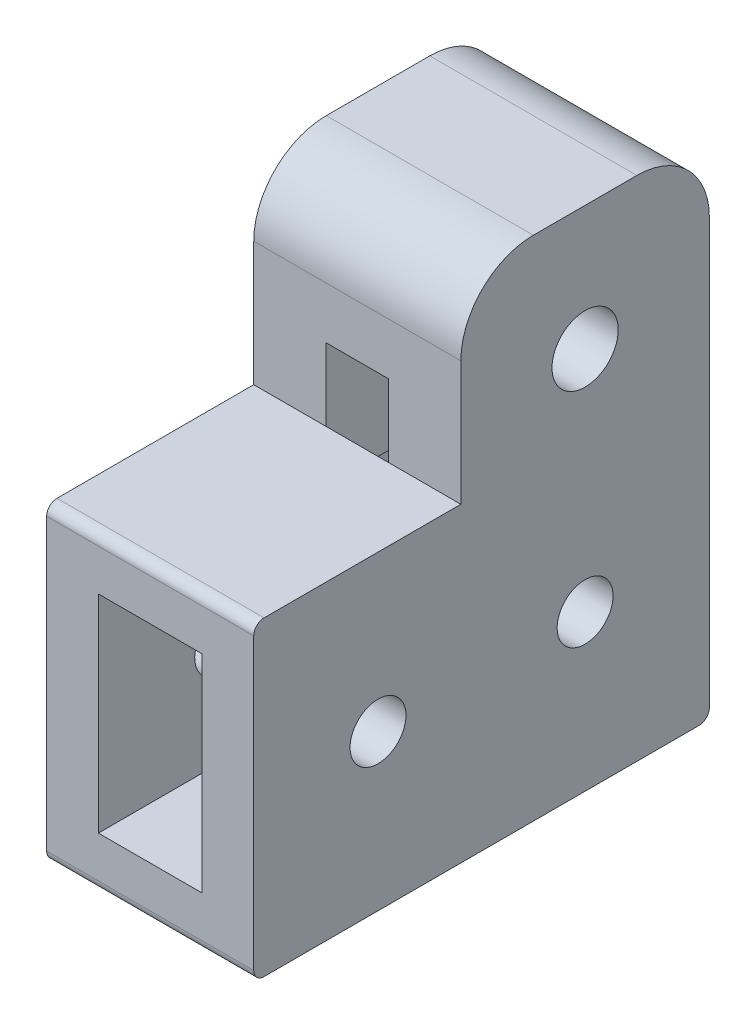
from build123d import *

# Parameters (mm, degrees)
SKETCH_1_R          = 2.7
SKETCH_1_R_2        = 3.2
EXTRUDE_1_DEPTH     = 10
FILLET_2_R          = 7
SKETCH_4_W          = 10
SKETCH_4_H          = 20
CUT_EXTRUDE_1_DEPTH = 53.076866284
FILLET_3_R          = 1


with BuildPart() as part:
    # Sketch 1 → Extrude 1 (new, symmetric)
    with BuildSketch(Plane.YZ):
        Polygon((-23, 20), (-23, -24), (26, -24), (26, 0), (7, 0), (7, 20), align=None)
        with Locations(Location((-8, 8, 0), (0, 0, 270))):
            Circle(SKETCH_1_R, mode=Mode.SUBTRACT)
        with Locations(Location((-8, -12, 0), (0, 0, 270))):
            Circle(SKETCH_1_R, mode=Mode.SUBTRACT)
        with Locations(Location((14, -12, 0), (0, 0, 270))):
            Circle(SKETCH_1_R_2, mode=Mode.SUBTRACT)
    extrude(amount=EXTRUDE_1_DEPTH, both=True)

    # Sketch 3 → Loft 1 section 0
    with BuildSketch(Plane(origin=(0, 0, -24), x_dir=(1, 0, 0), z_dir=(0, 0, -1))):
        with BuildLine():
            Line((-3, 18), (3, 18))
            Line((3, 18), (3, -2))
            Line((3, -2), (-3, -2))
            Line((-3, -2), (-3, 18))
        make_face()
    # Sketch 2 → Loft 1 section 1
    with BuildSketch(Plane.XY):
        with BuildLine():
            Line((-3, 14), (3, 14))
            Line((3, 14), (3, 7))
            Line((3, 7), (-3, 7))
            Line((-3, 7), (-3, 14))
        make_face()
    loft(mode=Mode.SUBTRACT)

    # Fillet 2
    fillet_2_edges = [part.edges().sort_by_distance(p)[0] for p in [
        (0, 26, 0),
        (0, 26, -24),
    ]]
    fillet(fillet_2_edges, radius=FILLET_2_R)

    # Sketch 4 → Cut-Extrude 1 (cut, through all)
    with BuildSketch(Plane(origin=(0, 0, -24), x_dir=(1, 0, 0), z_dir=(0, 0, -1))):
        with Locations((0, 8)):
            Rectangle(SKETCH_4_W, SKETCH_4_H)
    extrude(amount=-CUT_EXTRUDE_1_DEPTH, mode=Mode.SUBTRACT)

    # Fillet 3
    fillet_3_edges = [part.edges().sort_by_distance(p)[0] for p in [
        (0, 7, 20),
        (0, -23, -24),
        (0, -23, 20),
    ]]
    fillet(fillet_3_edges, radius=FILLET_3_R)


solid = part.part
